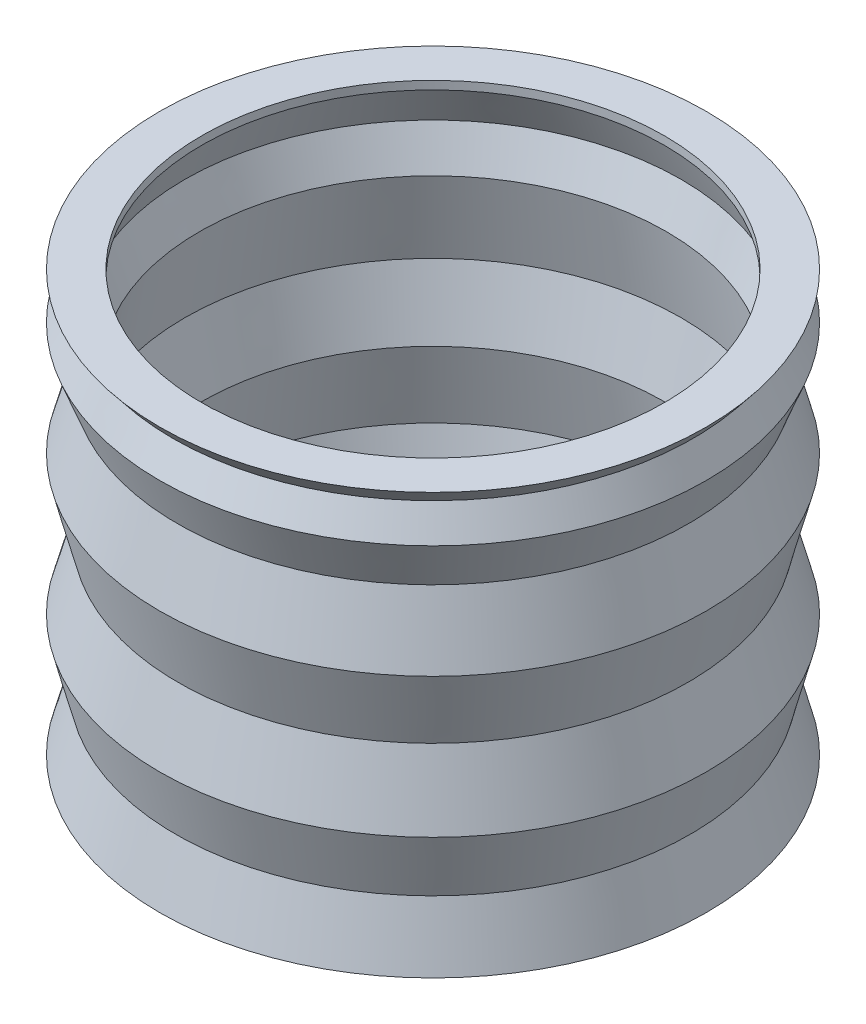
from build123d import *


with BuildPart() as part:
    # Esquisse1 → R_volution1 (revolve)
    with BuildSketch(Plane.XY, mode=Mode.PRIVATE) as r_volution1_sk:
        Polygon((-11, 0), (-13, 0), (-12.237322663, 2.842882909), (-13, 5.793164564), (-12.12723326, 9.046406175), (-13, 12.422549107), (-12.150038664, 15.590783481), (-13, 17.797758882), (-12.371487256, 19.213605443), (-13, 20), (-11, 20), (-11, 19.606802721), (-11.803058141, 17.797758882), (-11.107698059, 15.992214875), (-11.803058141, 12.101438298), (-11, 9.046406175), (-11.646323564, 5.430005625), (-11, 2.971230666), (-11.416090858, 0.643060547), (-11, 0.279980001), align=None)
    revolve(r_volution1_sk.sketch.rotate(Axis((0, 0, 0), (0, 1, 0)), 270), axis=Axis((0, 0, 0), (0, 1, 0)))


solid = part.part
